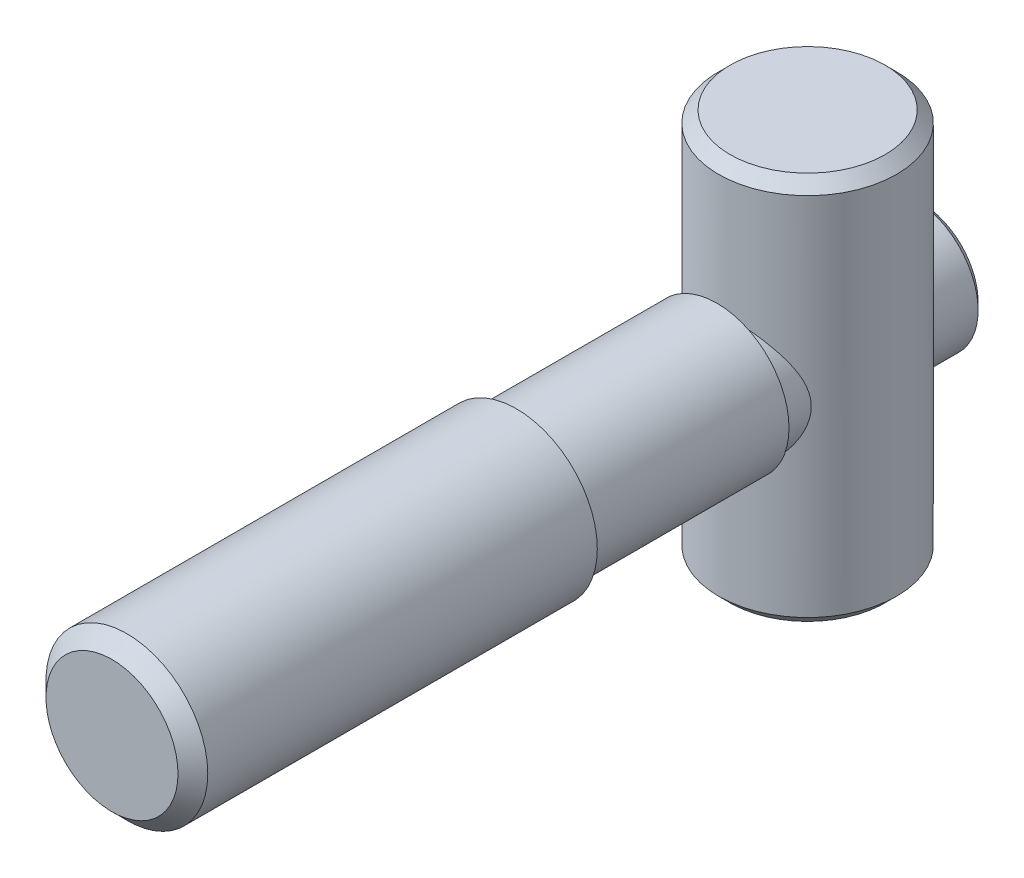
ISO-10303-21;
HEADER;
FILE_DESCRIPTION(('STEP AP214'),'2;1');
FILE_NAME('part.step','',(''),(''),'','','');
FILE_SCHEMA(('AUTOMOTIVE_DESIGN { 1 0 10303 214 1 1 1 1 }'));
ENDSEC;
DATA;
#1=APPLICATION_CONTEXT('core data for automotive mechanical design processes');
#2=APPLICATION_PROTOCOL_DEFINITION('international standard','automotive_design',2000,#1);
#3=PRODUCT_CONTEXT('',#1,'mechanical');
#4=PRODUCT('Part','Part','',(#3));
#5=PRODUCT_RELATED_PRODUCT_CATEGORY('part','',(#4));
#6=PRODUCT_DEFINITION_FORMATION('','',#4);
#7=PRODUCT_DEFINITION_CONTEXT('part definition',#1,'design');
#8=PRODUCT_DEFINITION('design','',#6,#7);
#9=PRODUCT_DEFINITION_SHAPE('','',#8);
#10=(LENGTH_UNIT() NAMED_UNIT(*) SI_UNIT(.MILLI.,.METRE.));
#11=(NAMED_UNIT(*) PLANE_ANGLE_UNIT() SI_UNIT($,.RADIAN.));
#12=(NAMED_UNIT(*) SI_UNIT($,.STERADIAN.) SOLID_ANGLE_UNIT());
#13=UNCERTAINTY_MEASURE_WITH_UNIT(LENGTH_MEASURE(1.E-05),#10,'distance_accuracy_value','');
#14=(GEOMETRIC_REPRESENTATION_CONTEXT(3) GLOBAL_UNCERTAINTY_ASSIGNED_CONTEXT((#13)) GLOBAL_UNIT_ASSIGNED_CONTEXT((#10,
#11,#12)) REPRESENTATION_CONTEXT('',''));
#15=CARTESIAN_POINT('',(0.,0.,0.));
#16=DIRECTION('',(0.,0.,1.));
#17=DIRECTION('',(1.,0.,0.));
#18=AXIS2_PLACEMENT_3D('',#15,#16,#17);
#19=CARTESIAN_POINT('',(0.,-12.,-18.3));
#20=DIRECTION('',(0.,-1.,0.));
#21=DIRECTION('',(-1.,0.,0.));
#22=AXIS2_PLACEMENT_3D('',#19,#20,#21);
#23=PLANE('',#22);
#24=CARTESIAN_POINT('',(0.,-12.,-18.3));
#25=DIRECTION('',(0.,-1.,0.));
#26=DIRECTION('',(-1.,0.,0.));
#27=AXIS2_PLACEMENT_3D('',#24,#25,#26);
#28=CIRCLE('',#27,4.79289321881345);
#29=CARTESIAN_POINT('',(-4.79289321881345,-12.,-18.3));
#30=VERTEX_POINT('',#29);
#31=EDGE_CURVE('E154',#30,#30,#28,.T.);
#32=ORIENTED_EDGE('',*,*,#31,.T.);
#33=EDGE_LOOP('',(#32));
#34=FACE_BOUND('',#33,.T.);
#35=ADVANCED_FACE('F14',(#34),#23,.T.);
#36=CARTESIAN_POINT('',(0.,12.,-18.3));
#37=DIRECTION('',(0.,1.,0.));
#38=DIRECTION('',(1.,0.,0.));
#39=AXIS2_PLACEMENT_3D('',#36,#37,#38);
#40=PLANE('',#39);
#41=CARTESIAN_POINT('',(0.,12.,-18.3));
#42=DIRECTION('',(0.,1.,0.));
#43=DIRECTION('',(1.,0.,0.));
#44=AXIS2_PLACEMENT_3D('',#41,#42,#43);
#45=CIRCLE('',#44,4.79289321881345);
#46=CARTESIAN_POINT('',(4.79289321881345,12.,-18.3));
#47=VERTEX_POINT('',#46);
#48=EDGE_CURVE('E166',#47,#47,#45,.T.);
#49=ORIENTED_EDGE('',*,*,#48,.T.);
#50=EDGE_LOOP('',(#49));
#51=FACE_BOUND('',#50,.T.);
#52=ADVANCED_FACE('F141',(#51),#40,.T.);
#53=CARTESIAN_POINT('',(0.,-12.,-18.3));
#54=DIRECTION('',(0.,1.,0.));
#55=DIRECTION('',(1.,0.,0.));
#56=AXIS2_PLACEMENT_3D('',#53,#54,#55);
#57=CONICAL_SURFACE('',#56,4.79289321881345,0.785398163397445);
#58=CARTESIAN_POINT('',(0.,-11.2928932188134,-18.3));
#59=DIRECTION('',(0.,-1.,0.));
#60=DIRECTION('',(-1.,0.,0.));
#61=AXIS2_PLACEMENT_3D('',#58,#59,#60);
#62=CIRCLE('',#61,5.5);
#63=CARTESIAN_POINT('',(-5.5,-11.2928932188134,-18.3));
#64=VERTEX_POINT('',#63);
#65=EDGE_CURVE('E162',#64,#64,#62,.F.);
#66=ORIENTED_EDGE('',*,*,#65,.F.);
#67=EDGE_LOOP('',(#66));
#68=FACE_BOUND('',#67,.T.);
#69=ORIENTED_EDGE('',*,*,#31,.F.);
#70=EDGE_LOOP('',(#69));
#71=FACE_BOUND('',#70,.T.);
#72=ADVANCED_FACE('F17',(#68,#71),#57,.T.);
#73=CARTESIAN_POINT('',(0.,12.,-18.3));
#74=DIRECTION('',(0.,-1.,0.));
#75=DIRECTION('',(-1.,0.,0.));
#76=AXIS2_PLACEMENT_3D('',#73,#74,#75);
#77=CONICAL_SURFACE('',#76,4.79289321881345,0.785398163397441);
#78=CARTESIAN_POINT('',(0.,11.2928932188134,-18.3));
#79=DIRECTION('',(0.,1.,0.));
#80=DIRECTION('',(1.,0.,0.));
#81=AXIS2_PLACEMENT_3D('',#78,#79,#80);
#82=CIRCLE('',#81,5.5);
#83=CARTESIAN_POINT('',(5.5,11.2928932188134,-18.3));
#84=VERTEX_POINT('',#83);
#85=EDGE_CURVE('E157',#84,#84,#82,.F.);
#86=ORIENTED_EDGE('',*,*,#85,.F.);
#87=EDGE_LOOP('',(#86));
#88=FACE_BOUND('',#87,.T.);
#89=ORIENTED_EDGE('',*,*,#48,.F.);
#90=EDGE_LOOP('',(#89));
#91=FACE_BOUND('',#90,.T.);
#92=ADVANCED_FACE('F126',(#88,#91),#77,.T.);
#93=CARTESIAN_POINT('',(0.,12.,-18.3));
#94=DIRECTION('',(0.,1.,0.));
#95=DIRECTION('',(1.,0.,0.));
#96=AXIS2_PLACEMENT_3D('',#93,#94,#95);
#97=CYLINDRICAL_SURFACE('',#96,5.5);
#98=DIRECTION('',(0.,1.,0.));
#99=VECTOR('',#98,1.);
#100=CARTESIAN_POINT('',(0.6,12.,-23.7671747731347));
#101=LINE('',#100,#99);
#102=CARTESIAN_POINT('',(0.6,-3.95474398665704,-23.7671747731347));
#103=VERTEX_POINT('',#102);
#104=CARTESIAN_POINT('',(0.6,3.95474398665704,-23.7671747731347));
#105=VERTEX_POINT('',#104);
#106=EDGE_CURVE('E9',#103,#105,#101,.T.);
#107=ORIENTED_EDGE('',*,*,#106,.F.);
#108=CARTESIAN_POINT('',(4.,0.,-22.0749172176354));
#109=CARTESIAN_POINT('',(3.99999971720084,0.094559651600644,-22.0749177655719));
#110=CARTESIAN_POINT('',(3.99663873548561,0.189122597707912,-22.078488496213));
#111=CARTESIAN_POINT('',(3.98328406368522,0.377297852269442,-22.0925637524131));
#112=CARTESIAN_POINT('',(3.97328671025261,0.470909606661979,-22.1030721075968));
#113=CARTESIAN_POINT('',(3.94687649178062,0.65648336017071,-22.1304732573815));
#114=CARTESIAN_POINT('',(3.93044906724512,0.748441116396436,-22.1473805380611));
#115=CARTESIAN_POINT('',(3.89152450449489,0.929870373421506,-22.1867470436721));
#116=CARTESIAN_POINT('',(3.86902376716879,1.01934036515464,-22.2092095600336));
#117=CARTESIAN_POINT('',(3.79365509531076,1.28093397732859,-22.2828450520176));
#118=CARTESIAN_POINT('',(3.73252985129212,1.44885844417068,-22.3407009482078));
#119=CARTESIAN_POINT('',(3.590688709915,1.77146295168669,-22.4672506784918));
#120=CARTESIAN_POINT('',(3.50997431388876,1.92614400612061,-22.5359436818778));
#121=CARTESIAN_POINT('',(3.31318173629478,2.25065582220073,-22.6922095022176));
#122=CARTESIAN_POINT('',(3.19328494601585,2.41764951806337,-22.7808675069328));
#123=CARTESIAN_POINT('',(2.92908108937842,2.73178094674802,-22.9578760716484));
#124=CARTESIAN_POINT('',(2.78474090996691,2.87889125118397,-23.0462260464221));
#125=CARTESIAN_POINT('',(2.5362822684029,3.09553636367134,-23.1814353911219));
#126=CARTESIAN_POINT('',(2.43963284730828,3.17231415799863,-23.2305740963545));
#127=CARTESIAN_POINT('',(2.23844845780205,3.31733570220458,-23.3251054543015));
#128=CARTESIAN_POINT('',(2.13391712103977,3.38558334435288,-23.3704998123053));
#129=CARTESIAN_POINT('',(1.91752007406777,3.51266692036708,-23.4562228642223));
#130=CARTESIAN_POINT('',(1.80566515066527,3.57151627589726,-23.49655876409));
#131=CARTESIAN_POINT('',(1.57523382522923,3.67896799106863,-23.5709873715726));
#132=CARTESIAN_POINT('',(1.45666071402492,3.72757531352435,-23.6050831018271));
#133=CARTESIAN_POINT('',(1.16188171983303,3.83193503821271,-23.678830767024));
#134=CARTESIAN_POINT('',(0.982606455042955,3.88193864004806,-23.7146815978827));
#135=CARTESIAN_POINT('',(0.616370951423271,3.95663720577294,-23.7684829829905));
#136=CARTESIAN_POINT('',(0.429417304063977,3.98135342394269,-23.7864485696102));
#137=CARTESIAN_POINT('',(0.052567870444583,4.00411402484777,-23.8029868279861));
#138=CARTESIAN_POINT('',(-0.137333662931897,4.00209732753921,-23.8015150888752));
#139=CARTESIAN_POINT('',(-0.51380986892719,3.97135939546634,-23.7791958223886));
#140=CARTESIAN_POINT('',(-0.700383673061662,3.94263129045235,-23.7583433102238));
#141=CARTESIAN_POINT('',(-1.05962164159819,3.86136821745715,-23.699944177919));
#142=CARTESIAN_POINT('',(-1.23253206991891,3.80954610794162,-23.6628980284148));
#143=CARTESIAN_POINT('',(-1.56671343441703,3.68473335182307,-23.5749694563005));
#144=CARTESIAN_POINT('',(-1.72798199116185,3.61173839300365,-23.5240842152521));
#145=CARTESIAN_POINT('',(-2.05370310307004,3.43803005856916,-23.4054456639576));
#146=CARTESIAN_POINT('',(-2.2165364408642,3.33514439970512,-23.3364494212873));
#147=CARTESIAN_POINT('',(-2.52348319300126,3.10940476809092,-23.189889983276));
#148=CARTESIAN_POINT('',(-2.66757825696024,2.98653148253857,-23.1123185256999));
#149=CARTESIAN_POINT('',(-2.96150593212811,2.69807007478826,-22.9383041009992));
#150=CARTESIAN_POINT('',(-3.10726104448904,2.52879913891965,-22.8410685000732));
#151=CARTESIAN_POINT('',(-3.36953999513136,2.16705523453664,-22.6499971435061));
#152=CARTESIAN_POINT('',(-3.48605965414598,1.97457895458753,-22.556161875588));
#153=CARTESIAN_POINT('',(-3.66526169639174,1.61165125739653,-22.402032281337));
#154=CARTESIAN_POINT('',(-3.73414032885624,1.44549066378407,-22.3388789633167));
#155=CARTESIAN_POINT('',(-3.84985589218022,1.10068331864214,-22.2287430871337));
#156=CARTESIAN_POINT('',(-3.89674227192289,0.922065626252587,-22.1817243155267));
#157=CARTESIAN_POINT('',(-3.9599937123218,0.585461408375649,-22.1170906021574));
#158=CARTESIAN_POINT('',(-3.98009730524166,0.428880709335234,-22.0959235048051));
#159=CARTESIAN_POINT('',(-4.00152507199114,0.113064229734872,-22.0733369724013));
#160=CARTESIAN_POINT('',(-4.00286519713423,-0.0461691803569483,-22.0719007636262));
#161=CARTESIAN_POINT('',(-3.98669865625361,-0.362327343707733,-22.0889767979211));
#162=CARTESIAN_POINT('',(-3.96921589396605,-0.519254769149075,-22.1074637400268));
#163=CARTESIAN_POINT('',(-3.91666535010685,-0.82717652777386,-22.1614916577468));
#164=CARTESIAN_POINT('',(-3.88157034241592,-0.978161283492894,-22.1970590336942));
#165=CARTESIAN_POINT('',(-3.77812999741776,-1.33113055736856,-22.2978469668));
#166=CARTESIAN_POINT('',(-3.70207893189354,-1.52906623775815,-22.3692423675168));
#167=CARTESIAN_POINT('',(-3.52270580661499,-1.90640842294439,-22.5254840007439));
#168=CARTESIAN_POINT('',(-3.41932922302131,-2.08577687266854,-22.6103569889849));
#169=CARTESIAN_POINT('',(-3.18411833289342,-2.43025180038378,-22.7870574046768));
#170=CARTESIAN_POINT('',(-3.05152555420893,-2.59477148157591,-22.8790168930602));
#171=CARTESIAN_POINT('',(-2.76125147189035,-2.90173861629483,-23.059699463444));
#172=CARTESIAN_POINT('',(-2.6035911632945,-3.04420434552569,-23.1484251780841));
#173=CARTESIAN_POINT('',(-2.271539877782,-3.2987599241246,-23.3122631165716));
#174=CARTESIAN_POINT('',(-2.09818660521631,-3.41190835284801,-23.3878018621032));
#175=CARTESIAN_POINT('',(-1.82330793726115,-3.56180731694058,-23.4899086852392));
#176=CARTESIAN_POINT('',(-1.72916099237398,-3.6084863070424,-23.5220894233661));
#177=CARTESIAN_POINT('',(-1.53632285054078,-3.69470582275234,-23.5820343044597));
#178=CARTESIAN_POINT('',(-1.43763386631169,-3.73424977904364,-23.6098005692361));
#179=CARTESIAN_POINT('',(-1.23534308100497,-3.80598862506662,-23.6604944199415));
#180=CARTESIAN_POINT('',(-1.13170490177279,-3.83811376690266,-23.683375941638));
#181=CARTESIAN_POINT('',(-0.921160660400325,-3.89401032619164,-23.7233693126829));
#182=CARTESIAN_POINT('',(-0.81425636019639,-3.9177861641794,-23.7404842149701));
#183=CARTESIAN_POINT('',(-0.598125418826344,-3.95655048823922,-23.7684652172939));
#184=CARTESIAN_POINT('',(-0.488900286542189,-3.9715445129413,-23.7793352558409));
#185=CARTESIAN_POINT('',(-0.269138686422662,-3.9924605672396,-23.7945144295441));
#186=CARTESIAN_POINT('',(-0.15860243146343,-3.99838404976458,-23.7988246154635));
#187=CARTESIAN_POINT('',(0.0467313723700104,-4.00084937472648,-23.8006178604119));
#188=CARTESIAN_POINT('',(0.141509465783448,-3.99861635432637,-23.7989924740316));
#189=CARTESIAN_POINT('',(0.330490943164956,-3.98744748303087,-23.7908762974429));
#190=CARTESIAN_POINT('',(0.424694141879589,-3.97850957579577,-23.7843840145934));
#191=CARTESIAN_POINT('',(0.611759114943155,-3.95406659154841,-23.7666782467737));
#192=CARTESIAN_POINT('',(0.704621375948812,-3.93856396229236,-23.7554665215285));
#193=CARTESIAN_POINT('',(0.88841574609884,-3.90122128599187,-23.7285691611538));
#194=CARTESIAN_POINT('',(0.979347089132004,-3.87937877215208,-23.7128817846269));
#195=CARTESIAN_POINT('',(1.24445933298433,-3.80583624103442,-23.6603363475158));
#196=CARTESIAN_POINT('',(1.41518501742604,-3.74554675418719,-23.6175701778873));
#197=CARTESIAN_POINT('',(1.74369677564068,-3.60438289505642,-23.5191022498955));
#198=CARTESIAN_POINT('',(1.90148075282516,-3.5235051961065,-23.4633984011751));
#199=CARTESIAN_POINT('',(2.22228203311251,-3.33179335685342,-23.3343972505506));
#200=CARTESIAN_POINT('',(2.38322541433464,-3.21841054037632,-23.2597469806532));
#201=CARTESIAN_POINT('',(2.68497920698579,-2.97136345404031,-23.103106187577));
#202=CARTESIAN_POINT('',(2.82576198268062,-2.8376718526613,-23.0211058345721));
#203=CARTESIAN_POINT('',(3.03332548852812,-2.61000808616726,-22.8888332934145));
#204=CARTESIAN_POINT('',(3.10699576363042,-2.5218601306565,-22.839152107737));
#205=CARTESIAN_POINT('',(3.24665706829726,-2.3393224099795,-22.7403298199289));
#206=CARTESIAN_POINT('',(3.31264615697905,-2.24493107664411,-22.69118885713));
#207=CARTESIAN_POINT('',(3.43660180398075,-2.0501419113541,-22.5948719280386));
#208=CARTESIAN_POINT('',(3.49457298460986,-1.94974758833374,-22.5476948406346));
#209=CARTESIAN_POINT('',(3.6021255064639,-1.74306577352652,-22.4568795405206));
#210=CARTESIAN_POINT('',(3.6517073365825,-1.63677862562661,-22.4132411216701));
#211=CARTESIAN_POINT('',(3.76078752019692,-1.37275858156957,-22.3142162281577));
#212=CARTESIAN_POINT('',(3.81580236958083,-1.21205137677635,-22.2615166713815));
#213=CARTESIAN_POINT('',(3.88309107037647,-0.963817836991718,-22.1952018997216));
#214=CARTESIAN_POINT('',(3.90296834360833,-0.879972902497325,-22.1752342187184));
#215=CARTESIAN_POINT('',(3.93739985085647,-0.710192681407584,-22.1402454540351));
#216=CARTESIAN_POINT('',(3.95195647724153,-0.62425835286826,-22.1252221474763));
#217=CARTESIAN_POINT('',(3.97571410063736,-0.449073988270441,-22.1005263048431));
#218=CARTESIAN_POINT('',(3.98480070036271,-0.359792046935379,-22.0909682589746));
#219=CARTESIAN_POINT('',(3.99694447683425,-0.180341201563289,-22.0781627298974));
#220=CARTESIAN_POINT('',(4.00000026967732,-0.0901720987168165,-22.0749166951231));
#221=CARTESIAN_POINT('',(4.,0.,-22.0749172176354));
#222=B_SPLINE_CURVE_WITH_KNOTS('',3,(#108,#109,#110,#111,#112,#113,#114,#115,#116,#117,#118,
#119,#120,#121,#122,#123,#124,#125,#126,#127,#128,#129,#130,#131,#132,#133,#134,#135,#136,#137,
#138,#139,#140,#141,#142,#143,#144,#145,#146,#147,#148,#149,#150,#151,#152,#153,#154,#155,#156,
#157,#158,#159,#160,#161,#162,#163,#164,#165,#166,#167,#168,#169,#170,#171,#172,#173,#174,#175,
#176,#177,#178,#179,#180,#181,#182,#183,#184,#185,#186,#187,#188,#189,#190,#191,#192,#193,#194,
#195,#196,#197,#198,#199,#200,#201,#202,#203,#204,#205,#206,#207,#208,#209,#210,#211,#212,#213,
#214,#215,#216,#217,#218,#219,#220,#221),.UNSPECIFIED.,.T.,.F.,(4,2,2,2,2,2,2,2,2,2,2,2,2,2,2,2,
2,2,2,2,2,2,2,2,2,2,2,2,2,2,2,2,2,2,2,2,2,2,2,2,2,2,2,2,2,2,2,2,2,2,2,2,2,2,2,2,4),(0.,
0.283560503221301,0.567277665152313,0.851640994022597,1.13617321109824,1.69729774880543,
2.25837929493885,2.92774006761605,3.59801497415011,3.99610080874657,4.39400433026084,
4.79133442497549,5.18847154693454,5.75445889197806,6.31997012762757,6.88677367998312,
7.45372305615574,8.00426875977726,8.5549266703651,9.16646484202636,9.77859745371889,
10.5066073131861,11.2347211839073,11.8047550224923,12.3735009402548,12.8491941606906,
13.3244829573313,13.7991688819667,14.2745908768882,14.94214771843,15.6110467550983,
16.2999460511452,16.9882713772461,17.6463931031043,17.9757519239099,18.3049519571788,
18.6371312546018,18.9691344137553,19.3009279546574,19.6326683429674,19.9167672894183,
20.2009534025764,20.4850336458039,20.7692245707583,21.3249022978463,21.8806698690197,
22.5100347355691,23.1402542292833,23.5154020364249,23.8906444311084,24.2656695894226,
24.6406728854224,25.1720162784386,25.4371121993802,25.7020887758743,25.9724300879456,
26.24283342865),.UNSPECIFIED.);
#223=EDGE_CURVE('E112',#103,#105,#222,.T.);
#224=ORIENTED_EDGE('',*,*,#223,.T.);
#225=EDGE_LOOP('',(#107,#224));
#226=FACE_BOUND('',#225,.T.);
#227=ORIENTED_EDGE('',*,*,#85,.T.);
#228=EDGE_LOOP('',(#227));
#229=FACE_BOUND('',#228,.T.);
#230=ORIENTED_EDGE('',*,*,#65,.T.);
#231=EDGE_LOOP('',(#230));
#232=FACE_BOUND('',#231,.T.);
#233=CARTESIAN_POINT('',(4.,0.,-14.5250827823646));
#234=CARTESIAN_POINT('',(3.99999971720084,-0.0945596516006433,-14.5250822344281));
#235=CARTESIAN_POINT('',(3.99663873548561,-0.189122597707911,-14.521511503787));
#236=CARTESIAN_POINT('',(3.98328406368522,-0.37729785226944,-14.5074362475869));
#237=CARTESIAN_POINT('',(3.97328671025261,-0.470909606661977,-14.4969278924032));
#238=CARTESIAN_POINT('',(3.94687649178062,-0.65648336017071,-14.4695267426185));
#239=CARTESIAN_POINT('',(3.93044906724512,-0.748441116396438,-14.4526194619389));
#240=CARTESIAN_POINT('',(3.89152450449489,-0.929870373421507,-14.4132529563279));
#241=CARTESIAN_POINT('',(3.86902376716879,-1.01934036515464,-14.3907904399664));
#242=CARTESIAN_POINT('',(3.79365509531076,-1.28093397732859,-14.3171549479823));
#243=CARTESIAN_POINT('',(3.73252985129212,-1.44885844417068,-14.2592990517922));
#244=CARTESIAN_POINT('',(3.590688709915,-1.7714629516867,-14.1327493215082));
#245=CARTESIAN_POINT('',(3.50997431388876,-1.92614400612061,-14.0640563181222));
#246=CARTESIAN_POINT('',(3.31318173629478,-2.25065582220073,-13.9077904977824));
#247=CARTESIAN_POINT('',(3.19328494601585,-2.41764951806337,-13.8191324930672));
#248=CARTESIAN_POINT('',(2.92908108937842,-2.73178094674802,-13.6421239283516));
#249=CARTESIAN_POINT('',(2.78474090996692,-2.87889125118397,-13.5537739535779));
#250=CARTESIAN_POINT('',(2.53628226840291,-3.09553636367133,-13.4185646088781));
#251=CARTESIAN_POINT('',(2.43963284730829,-3.17231415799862,-13.3694259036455));
#252=CARTESIAN_POINT('',(2.23844845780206,-3.31733570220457,-13.2748945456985));
#253=CARTESIAN_POINT('',(2.13391712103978,-3.38558334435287,-13.2295001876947));
#254=CARTESIAN_POINT('',(1.91752007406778,-3.51266692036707,-13.1437771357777));
#255=CARTESIAN_POINT('',(1.80566515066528,-3.57151627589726,-13.10344123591));
#256=CARTESIAN_POINT('',(1.57523382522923,-3.67896799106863,-13.0290126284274));
#257=CARTESIAN_POINT('',(1.45666071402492,-3.72757531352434,-12.9949168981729));
#258=CARTESIAN_POINT('',(1.16188171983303,-3.83193503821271,-12.921169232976));
#259=CARTESIAN_POINT('',(0.982606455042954,-3.88193864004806,-12.8853184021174));
#260=CARTESIAN_POINT('',(0.616370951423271,-3.95663720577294,-12.8315170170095));
#261=CARTESIAN_POINT('',(0.429417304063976,-3.98135342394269,-12.8135514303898));
#262=CARTESIAN_POINT('',(0.0525678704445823,-4.00411402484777,-12.7970131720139));
#263=CARTESIAN_POINT('',(-0.137333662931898,-4.00209732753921,-12.7984849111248));
#264=CARTESIAN_POINT('',(-0.51380986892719,-3.97135939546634,-12.8208041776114));
#265=CARTESIAN_POINT('',(-0.700383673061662,-3.94263129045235,-12.8416566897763));
#266=CARTESIAN_POINT('',(-1.05962164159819,-3.86136821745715,-12.900055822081));
#267=CARTESIAN_POINT('',(-1.23253206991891,-3.80954610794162,-12.9371019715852));
#268=CARTESIAN_POINT('',(-1.56671343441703,-3.68473335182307,-13.0250305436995));
#269=CARTESIAN_POINT('',(-1.72798199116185,-3.61173839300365,-13.0759157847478));
#270=CARTESIAN_POINT('',(-2.05370310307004,-3.43803005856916,-13.1945543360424));
#271=CARTESIAN_POINT('',(-2.2165364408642,-3.33514439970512,-13.2635505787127));
#272=CARTESIAN_POINT('',(-2.52348319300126,-3.10940476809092,-13.410110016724));
#273=CARTESIAN_POINT('',(-2.66757825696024,-2.98653148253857,-13.4876814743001));
#274=CARTESIAN_POINT('',(-2.96150593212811,-2.69807007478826,-13.6616958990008));
#275=CARTESIAN_POINT('',(-3.10726104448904,-2.52879913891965,-13.7589314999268));
#276=CARTESIAN_POINT('',(-3.36953999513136,-2.16705523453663,-13.9500028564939));
#277=CARTESIAN_POINT('',(-3.48605965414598,-1.97457895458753,-14.043838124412));
#278=CARTESIAN_POINT('',(-3.66526169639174,-1.61165125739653,-14.197967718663));
#279=CARTESIAN_POINT('',(-3.73414032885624,-1.44549066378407,-14.2611210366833));
#280=CARTESIAN_POINT('',(-3.84985589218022,-1.10068331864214,-14.3712569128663));
#281=CARTESIAN_POINT('',(-3.8967422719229,-0.922065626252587,-14.4182756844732));
#282=CARTESIAN_POINT('',(-3.95999371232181,-0.585461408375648,-14.4829093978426));
#283=CARTESIAN_POINT('',(-3.98009730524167,-0.428880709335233,-14.5040764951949));
#284=CARTESIAN_POINT('',(-4.00152507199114,-0.113064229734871,-14.5266630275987));
#285=CARTESIAN_POINT('',(-4.00286519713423,0.0461691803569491,-14.5280992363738));
#286=CARTESIAN_POINT('',(-3.98669865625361,0.362327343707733,-14.5110232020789));
#287=CARTESIAN_POINT('',(-3.96921589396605,0.519254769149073,-14.4925362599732));
#288=CARTESIAN_POINT('',(-3.91666535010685,0.827176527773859,-14.4385083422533));
#289=CARTESIAN_POINT('',(-3.88157034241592,0.978161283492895,-14.4029409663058));
#290=CARTESIAN_POINT('',(-3.77812999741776,1.33113055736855,-14.3021530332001));
#291=CARTESIAN_POINT('',(-3.70207893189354,1.52906623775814,-14.2307576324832));
#292=CARTESIAN_POINT('',(-3.522705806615,1.90640842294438,-14.0745159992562));
#293=CARTESIAN_POINT('',(-3.41932922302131,2.08577687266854,-13.9896430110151));
#294=CARTESIAN_POINT('',(-3.18411833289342,2.43025180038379,-13.8129425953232));
#295=CARTESIAN_POINT('',(-3.05152555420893,2.59477148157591,-13.7209831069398));
#296=CARTESIAN_POINT('',(-2.76125147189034,2.90173861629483,-13.540300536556));
#297=CARTESIAN_POINT('',(-2.6035911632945,3.04420434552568,-13.4515748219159));
#298=CARTESIAN_POINT('',(-2.271539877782,3.2987599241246,-13.2877368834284));
#299=CARTESIAN_POINT('',(-2.09818660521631,3.41190835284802,-13.2121981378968));
#300=CARTESIAN_POINT('',(-1.82330793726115,3.56180731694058,-13.1100913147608));
#301=CARTESIAN_POINT('',(-1.72916099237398,3.6084863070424,-13.0779105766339));
#302=CARTESIAN_POINT('',(-1.53632285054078,3.69470582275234,-13.0179656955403));
#303=CARTESIAN_POINT('',(-1.43763386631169,3.73424977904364,-12.990199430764));
#304=CARTESIAN_POINT('',(-1.23534308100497,3.80598862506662,-12.9395055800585));
#305=CARTESIAN_POINT('',(-1.13170490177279,3.83811376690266,-12.916624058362));
#306=CARTESIAN_POINT('',(-0.921160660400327,3.89401032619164,-12.8766306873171));
#307=CARTESIAN_POINT('',(-0.814256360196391,3.9177861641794,-12.8595157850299));
#308=CARTESIAN_POINT('',(-0.598125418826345,3.95655048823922,-12.8315347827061));
#309=CARTESIAN_POINT('',(-0.488900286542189,3.9715445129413,-12.8206647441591));
#310=CARTESIAN_POINT('',(-0.269138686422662,3.9924605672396,-12.8054855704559));
#311=CARTESIAN_POINT('',(-0.158602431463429,3.99838404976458,-12.8011753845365));
#312=CARTESIAN_POINT('',(0.046731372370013,4.00084937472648,-12.7993821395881));
#313=CARTESIAN_POINT('',(0.141509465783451,3.99861635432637,-12.8010075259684));
#314=CARTESIAN_POINT('',(0.330490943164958,3.98744748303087,-12.8091237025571));
#315=CARTESIAN_POINT('',(0.424694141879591,3.97850957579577,-12.8156159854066));
#316=CARTESIAN_POINT('',(0.611759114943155,3.95406659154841,-12.8333217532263));
#317=CARTESIAN_POINT('',(0.704621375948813,3.93856396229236,-12.8445334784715));
#318=CARTESIAN_POINT('',(0.88841574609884,3.90122128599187,-12.8714308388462));
#319=CARTESIAN_POINT('',(0.979347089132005,3.87937877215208,-12.8871182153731));
#320=CARTESIAN_POINT('',(1.24445933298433,3.80583624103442,-12.9396636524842));
#321=CARTESIAN_POINT('',(1.41518501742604,3.74554675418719,-12.9824298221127));
#322=CARTESIAN_POINT('',(1.74369677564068,3.60438289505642,-13.0808977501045));
#323=CARTESIAN_POINT('',(1.90148075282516,3.5235051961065,-13.1366015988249));
#324=CARTESIAN_POINT('',(2.22228203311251,3.33179335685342,-13.2656027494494));
#325=CARTESIAN_POINT('',(2.38322541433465,3.21841054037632,-13.3402530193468));
#326=CARTESIAN_POINT('',(2.68497920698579,2.97136345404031,-13.496893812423));
#327=CARTESIAN_POINT('',(2.82576198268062,2.8376718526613,-13.5788941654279));
#328=CARTESIAN_POINT('',(3.03332548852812,2.61000808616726,-13.7111667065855));
#329=CARTESIAN_POINT('',(3.10699576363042,2.5218601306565,-13.760847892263));
#330=CARTESIAN_POINT('',(3.24665706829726,2.33932240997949,-13.8596701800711));
#331=CARTESIAN_POINT('',(3.31264615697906,2.24493107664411,-13.9088111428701));
#332=CARTESIAN_POINT('',(3.43660180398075,2.05014191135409,-14.0051280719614));
#333=CARTESIAN_POINT('',(3.49457298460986,1.94974758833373,-14.0523051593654));
#334=CARTESIAN_POINT('',(3.60212550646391,1.74306577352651,-14.1431204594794));
#335=CARTESIAN_POINT('',(3.65170733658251,1.6367786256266,-14.18675887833));
#336=CARTESIAN_POINT('',(3.76078752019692,1.37275858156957,-14.2857837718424));
#337=CARTESIAN_POINT('',(3.81580236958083,1.21205137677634,-14.3384833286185));
#338=CARTESIAN_POINT('',(3.88309107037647,0.963817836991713,-14.4047981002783));
#339=CARTESIAN_POINT('',(3.90296834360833,0.879972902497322,-14.4247657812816));
#340=CARTESIAN_POINT('',(3.93739985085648,0.71019268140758,-14.4597545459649));
#341=CARTESIAN_POINT('',(3.95195647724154,0.624258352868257,-14.4747778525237));
#342=CARTESIAN_POINT('',(3.97571410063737,0.449073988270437,-14.4994736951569));
#343=CARTESIAN_POINT('',(3.98480070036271,0.359792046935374,-14.5090317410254));
#344=CARTESIAN_POINT('',(3.99694447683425,0.180341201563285,-14.5218372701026));
#345=CARTESIAN_POINT('',(4.00000026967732,0.0901720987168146,-14.525083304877));
#346=CARTESIAN_POINT('',(4.,0.,-14.5250827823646));
#347=B_SPLINE_CURVE_WITH_KNOTS('',3,(#233,#234,#235,#236,#237,#238,#239,#240,#241,#242,#243,
#244,#245,#246,#247,#248,#249,#250,#251,#252,#253,#254,#255,#256,#257,#258,#259,#260,#261,#262,
#263,#264,#265,#266,#267,#268,#269,#270,#271,#272,#273,#274,#275,#276,#277,#278,#279,#280,#281,
#282,#283,#284,#285,#286,#287,#288,#289,#290,#291,#292,#293,#294,#295,#296,#297,#298,#299,#300,
#301,#302,#303,#304,#305,#306,#307,#308,#309,#310,#311,#312,#313,#314,#315,#316,#317,#318,#319,
#320,#321,#322,#323,#324,#325,#326,#327,#328,#329,#330,#331,#332,#333,#334,#335,#336,#337,#338,
#339,#340,#341,#342,#343,#344,#345,#346),.UNSPECIFIED.,.T.,.F.,(4,2,2,2,2,2,2,2,2,2,2,2,2,2,2,2,
2,2,2,2,2,2,2,2,2,2,2,2,2,2,2,2,2,2,2,2,2,2,2,2,2,2,2,2,2,2,2,2,2,2,2,2,2,2,2,2,4),(0.,
0.2835605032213,0.567277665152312,0.851640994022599,1.13617321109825,1.69729774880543,
2.25837929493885,2.92774006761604,3.59801497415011,3.99610080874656,4.39400433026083,
4.79133442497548,5.18847154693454,5.75445889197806,6.31997012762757,6.88677367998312,
7.45372305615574,8.00426875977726,8.5549266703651,9.16646484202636,9.77859745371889,
10.5066073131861,11.2347211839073,11.8047550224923,12.3735009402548,12.8491941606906,
13.3244829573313,13.7991688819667,14.2745908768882,14.94214771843,15.6110467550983,
16.2999460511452,16.9882713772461,17.6463931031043,17.9757519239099,18.3049519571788,
18.6371312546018,18.9691344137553,19.3009279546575,19.6326683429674,19.9167672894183,
20.2009534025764,20.4850336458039,20.7692245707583,21.3249022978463,21.8806698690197,
22.5100347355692,23.1402542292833,23.5154020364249,23.8906444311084,24.2656695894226,
24.6406728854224,25.1720162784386,25.4371121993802,25.7020887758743,25.9724300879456,
26.24283342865),.UNSPECIFIED.);
#348=CARTESIAN_POINT('',(4.,0.,-14.5250827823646));
#349=VERTEX_POINT('',#348);
#350=EDGE_CURVE('E104',#349,#349,#347,.T.);
#351=ORIENTED_EDGE('',*,*,#350,.T.);
#352=EDGE_LOOP('',(#351));
#353=FACE_BOUND('',#352,.T.);
#354=CARTESIAN_POINT('',(-0.6,3.95474398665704,-23.7671747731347));
#355=VERTEX_POINT('',#354);
#356=CARTESIAN_POINT('',(-0.6,-3.95474398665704,-23.7671747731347));
#357=VERTEX_POINT('',#356);
#358=EDGE_CURVE('E30',#355,#357,#222,.T.);
#359=ORIENTED_EDGE('',*,*,#358,.T.);
#360=DIRECTION('',(0.,1.,0.));
#361=VECTOR('',#360,1.);
#362=CARTESIAN_POINT('',(-0.6,12.,-23.7671747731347));
#363=LINE('',#362,#361);
#364=EDGE_CURVE('E19',#357,#355,#363,.T.);
#365=ORIENTED_EDGE('',*,*,#364,.T.);
#366=EDGE_LOOP('',(#359,#365));
#367=FACE_BOUND('',#366,.T.);
#368=ADVANCED_FACE('F121',(#226,#229,#232,#353,#367),#97,.T.);
#369=CARTESIAN_POINT('',(4.08,0.,24.7));
#370=DIRECTION('',(0.,0.,-1.));
#371=DIRECTION('',(-1.,0.,0.));
#372=AXIS2_PLACEMENT_3D('',#369,#370,#371);
#373=PLANE('',#372);
#374=CARTESIAN_POINT('',(0.,0.,24.7));
#375=DIRECTION('',(0.,0.,1.));
#376=DIRECTION('',(1.,0.,0.));
#377=AXIS2_PLACEMENT_3D('',#374,#375,#376);
#378=CIRCLE('',#377,4.08);
#379=CARTESIAN_POINT('',(4.08,0.,24.7));
#380=VERTEX_POINT('',#379);
#381=EDGE_CURVE('E189',#380,#380,#378,.T.);
#382=ORIENTED_EDGE('',*,*,#381,.T.);
#383=EDGE_LOOP('',(#382));
#384=FACE_BOUND('',#383,.T.);
#385=ADVANCED_FACE('F125',(#384),#373,.F.);
#386=CARTESIAN_POINT('',(0.,0.,23.78));
#387=DIRECTION('',(0.,0.,-1.));
#388=DIRECTION('',(-1.,0.,0.));
#389=AXIS2_PLACEMENT_3D('',#386,#387,#388);
#390=CONICAL_SURFACE('',#389,5.,0.785398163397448);
#391=ORIENTED_EDGE('',*,*,#381,.F.);
#392=EDGE_LOOP('',(#391));
#393=FACE_BOUND('',#392,.T.);
#394=CARTESIAN_POINT('',(0.,0.,23.78));
#395=DIRECTION('',(0.,0.,1.));
#396=DIRECTION('',(1.,0.,0.));
#397=AXIS2_PLACEMENT_3D('',#394,#395,#396);
#398=CIRCLE('',#397,5.);
#399=CARTESIAN_POINT('',(5.,0.,23.78));
#400=VERTEX_POINT('',#399);
#401=EDGE_CURVE('E193',#400,#400,#398,.T.);
#402=ORIENTED_EDGE('',*,*,#401,.T.);
#403=EDGE_LOOP('',(#402));
#404=FACE_BOUND('',#403,.T.);
#405=ADVANCED_FACE('F217',(#393,#404),#390,.T.);
#406=CARTESIAN_POINT('',(0.,0.,24.7));
#407=DIRECTION('',(0.,0.,1.));
#408=DIRECTION('',(1.,0.,0.));
#409=AXIS2_PLACEMENT_3D('',#406,#407,#408);
#410=CYLINDRICAL_SURFACE('',#409,5.);
#411=ORIENTED_EDGE('',*,*,#401,.F.);
#412=EDGE_LOOP('',(#411));
#413=FACE_BOUND('',#412,.T.);
#414=CARTESIAN_POINT('',(0.,0.,-0.300000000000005));
#415=DIRECTION('',(0.,0.,1.));
#416=DIRECTION('',(1.,0.,0.));
#417=AXIS2_PLACEMENT_3D('',#414,#415,#416);
#418=CIRCLE('',#417,5.);
#419=CARTESIAN_POINT('',(5.,0.,-0.300000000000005));
#420=VERTEX_POINT('',#419);
#421=EDGE_CURVE('E95',#420,#420,#418,.T.);
#422=ORIENTED_EDGE('',*,*,#421,.T.);
#423=EDGE_LOOP('',(#422));
#424=FACE_BOUND('',#423,.T.);
#425=ADVANCED_FACE('F221',(#413,#424),#410,.T.);
#426=CARTESIAN_POINT('',(0.,0.,-0.300000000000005));
#427=DIRECTION('',(0.,0.,1.));
#428=DIRECTION('',(1.,0.,0.));
#429=AXIS2_PLACEMENT_3D('',#426,#427,#428);
#430=PLANE('',#429);
#431=ORIENTED_EDGE('',*,*,#421,.F.);
#432=EDGE_LOOP('',(#431));
#433=FACE_BOUND('',#432,.T.);
#434=CARTESIAN_POINT('',(0.,0.,-0.300000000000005));
#435=DIRECTION('',(0.,0.,1.));
#436=DIRECTION('',(1.,0.,0.));
#437=AXIS2_PLACEMENT_3D('',#434,#435,#436);
#438=CIRCLE('',#437,4.45);
#439=CARTESIAN_POINT('',(4.45,0.,-0.300000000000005));
#440=VERTEX_POINT('',#439);
#441=EDGE_CURVE('E91',#440,#440,#438,.T.);
#442=ORIENTED_EDGE('',*,*,#441,.T.);
#443=EDGE_LOOP('',(#442));
#444=FACE_BOUND('',#443,.T.);
#445=ADVANCED_FACE('F225',(#433,#444),#430,.F.);
#446=CARTESIAN_POINT('',(0.,0.,-0.300000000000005));
#447=DIRECTION('',(0.,0.,1.));
#448=DIRECTION('',(1.,0.,0.));
#449=AXIS2_PLACEMENT_3D('',#446,#447,#448);
#450=CYLINDRICAL_SURFACE('',#449,4.45);
#451=ORIENTED_EDGE('',*,*,#441,.F.);
#452=EDGE_LOOP('',(#451));
#453=FACE_BOUND('',#452,.T.);
#454=CARTESIAN_POINT('',(0.,0.,-12.7));
#455=DIRECTION('',(0.,0.,-1.));
#456=DIRECTION('',(-1.,0.,0.));
#457=AXIS2_PLACEMENT_3D('',#454,#455,#456);
#458=CIRCLE('',#457,4.45);
#459=CARTESIAN_POINT('',(-4.45,0.,-12.7));
#460=VERTEX_POINT('',#459);
#461=EDGE_CURVE('E84',#460,#460,#458,.T.);
#462=ORIENTED_EDGE('',*,*,#461,.F.);
#463=EDGE_LOOP('',(#462));
#464=FACE_BOUND('',#463,.T.);
#465=ADVANCED_FACE('F228',(#453,#464),#450,.T.);
#466=CARTESIAN_POINT('',(0.,0.,-12.7));
#467=DIRECTION('',(0.,0.,-1.));
#468=DIRECTION('',(-1.,0.,0.));
#469=AXIS2_PLACEMENT_3D('',#466,#467,#468);
#470=PLANE('',#469);
#471=CARTESIAN_POINT('',(0.,0.,-12.7));
#472=DIRECTION('',(0.,0.,-1.));
#473=DIRECTION('',(-1.,0.,0.));
#474=AXIS2_PLACEMENT_3D('',#471,#472,#473);
#475=CIRCLE('',#474,4.);
#476=CARTESIAN_POINT('',(-4.,0.,-12.7));
#477=VERTEX_POINT('',#476);
#478=EDGE_CURVE('E156',#477,#477,#475,.T.);
#479=ORIENTED_EDGE('',*,*,#478,.F.);
#480=EDGE_LOOP('',(#479));
#481=FACE_BOUND('',#480,.T.);
#482=ORIENTED_EDGE('',*,*,#461,.T.);
#483=EDGE_LOOP('',(#482));
#484=FACE_BOUND('',#483,.T.);
#485=ADVANCED_FACE('F231',(#481,#484),#470,.T.);
#486=CARTESIAN_POINT('',(0.,0.,-12.8));
#487=DIRECTION('',(0.,0.,1.));
#488=DIRECTION('',(1.,0.,0.));
#489=AXIS2_PLACEMENT_3D('',#486,#487,#488);
#490=CYLINDRICAL_SURFACE('',#489,4.);
#491=ORIENTED_EDGE('',*,*,#478,.T.);
#492=EDGE_LOOP('',(#491));
#493=FACE_BOUND('',#492,.T.);
#494=ORIENTED_EDGE('',*,*,#350,.F.);
#495=EDGE_LOOP('',(#494));
#496=FACE_BOUND('',#495,.T.);
#497=ADVANCED_FACE('F237',(#493,#496),#490,.T.);
#498=CARTESIAN_POINT('',(0.,0.,-25.3));
#499=DIRECTION('',(0.,0.,1.));
#500=DIRECTION('',(1.,0.,0.));
#501=AXIS2_PLACEMENT_3D('',#498,#499,#500);
#502=PLANE('',#501);
#503=DIRECTION('',(0.,-1.,0.));
#504=VECTOR('',#503,1.);
#505=CARTESIAN_POINT('',(0.6,0.,-25.3));
#506=LINE('',#505,#504);
#507=CARTESIAN_POINT('',(0.6,3.48878202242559,-25.3));
#508=VERTEX_POINT('',#507);
#509=CARTESIAN_POINT('',(0.6,-3.48878202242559,-25.3));
#510=VERTEX_POINT('',#509);
#511=EDGE_CURVE('E83',#508,#510,#506,.T.);
#512=ORIENTED_EDGE('',*,*,#511,.F.);
#513=CARTESIAN_POINT('',(0.,0.,-25.3));
#514=DIRECTION('',(0.,0.,1.));
#515=DIRECTION('',(1.,0.,0.));
#516=AXIS2_PLACEMENT_3D('',#513,#514,#515);
#517=CIRCLE('',#516,3.54);
#518=EDGE_CURVE('E82',#510,#508,#517,.T.);
#519=ORIENTED_EDGE('',*,*,#518,.F.);
#520=EDGE_LOOP('',(#512,#519));
#521=FACE_BOUND('',#520,.T.);
#522=ADVANCED_FACE('F249',(#521),#502,.F.);
#523=CARTESIAN_POINT('',(0.,0.,-25.3));
#524=DIRECTION('',(0.,0.,1.));
#525=DIRECTION('',(1.,0.,0.));
#526=AXIS2_PLACEMENT_3D('',#523,#524,#525);
#527=CONICAL_SURFACE('',#526,3.54,0.785398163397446);
#528=CARTESIAN_POINT('',(0.6,3.9554519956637,-24.8393));
#529=CARTESIAN_POINT('',(0.6,3.83941046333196,-24.9540237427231));
#530=CARTESIAN_POINT('',(0.6,3.72331727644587,-25.0686953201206));
#531=CARTESIAN_POINT('',(0.6,3.49091447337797,-25.2979511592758));
#532=CARTESIAN_POINT('',(0.6,3.37460477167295,-25.4125353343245));
#533=CARTESIAN_POINT('',(0.6,3.14054409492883,-25.642725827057));
#534=CARTESIAN_POINT('',(0.6,3.02279099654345,-25.7583299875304));
#535=CARTESIAN_POINT('',(0.6,2.78706506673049,-25.9891808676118));
#536=CARTESIAN_POINT('',(0.6,2.66909239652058,-26.1044277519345));
#537=CARTESIAN_POINT('',(0.6,2.38769992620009,-26.3783597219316));
#538=CARTESIAN_POINT('',(0.6,2.2240974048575,-26.536857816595));
#539=CARTESIAN_POINT('',(0.6,1.97745696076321,-26.7736454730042));
#540=CARTESIAN_POINT('',(0.6,1.89495476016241,-26.8524926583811));
#541=CARTESIAN_POINT('',(0.6,1.72944434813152,-27.0096193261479));
#542=CARTESIAN_POINT('',(0.6,1.64643625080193,-27.0878989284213));
#543=CARTESIAN_POINT('',(0.6,1.48033289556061,-27.2429690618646));
#544=CARTESIAN_POINT('',(0.6,1.39724415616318,-27.319766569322));
#545=CARTESIAN_POINT('',(0.6,1.2297853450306,-27.4721053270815));
#546=CARTESIAN_POINT('',(0.6,1.14541426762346,-27.5476454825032));
#547=CARTESIAN_POINT('',(0.6,1.01743134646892,-27.6590099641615));
#548=CARTESIAN_POINT('',(0.6,0.974611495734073,-27.6957423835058));
#549=CARTESIAN_POINT('',(0.6,0.88825104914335,-27.7683476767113));
#550=CARTESIAN_POINT('',(0.6,0.844710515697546,-27.8042206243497));
#551=CARTESIAN_POINT('',(0.6,0.756681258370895,-27.8746657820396));
#552=CARTESIAN_POINT('',(0.6,0.712193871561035,-27.9092396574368));
#553=CARTESIAN_POINT('',(0.6,0.621791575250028,-27.9764590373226));
#554=CARTESIAN_POINT('',(0.6,0.575877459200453,-28.0091055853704));
#555=CARTESIAN_POINT('',(0.6,0.517059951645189,-28.0479937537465));
#556=CARTESIAN_POINT('',(0.6,0.505142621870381,-28.0557273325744));
#557=CARTESIAN_POINT('',(0.6,0.481156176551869,-28.0709583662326));
#558=CARTESIAN_POINT('',(0.6,0.469087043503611,-28.0784557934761));
#559=CARTESIAN_POINT('',(0.6,0.432629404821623,-28.1005451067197));
#560=CARTESIAN_POINT('',(0.6,0.407992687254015,-28.1147326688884));
#561=CARTESIAN_POINT('',(0.6,0.358127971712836,-28.1415606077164));
#562=CARTESIAN_POINT('',(0.6,0.332906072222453,-28.1542121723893));
#563=CARTESIAN_POINT('',(0.6,0.28159268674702,-28.1776006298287));
#564=CARTESIAN_POINT('',(0.6,0.255501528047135,-28.1883382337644));
#565=CARTESIAN_POINT('',(0.6,0.19385499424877,-28.2103112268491));
#566=CARTESIAN_POINT('',(0.6,0.157946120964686,-28.2206034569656));
#567=CARTESIAN_POINT('',(0.6,0.0849893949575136,-28.2350528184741));
#568=CARTESIAN_POINT('',(0.6,0.0479465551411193,-28.2392338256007));
#569=CARTESIAN_POINT('',(0.6,-0.0264554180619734,-28.2405737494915));
#570=CARTESIAN_POINT('',(0.6,-0.0638152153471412,-28.237698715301));
#571=CARTESIAN_POINT('',(0.6,-0.137530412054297,-28.2255268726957));
#572=CARTESIAN_POINT('',(0.6,-0.173882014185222,-28.2162085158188));
#573=CARTESIAN_POINT('',(0.6,-0.246261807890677,-28.1923675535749));
#574=CARTESIAN_POINT('',(0.6,-0.282227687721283,-28.1776642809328));
#575=CARTESIAN_POINT('',(0.6,-0.352560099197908,-28.1447807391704));
#576=CARTESIAN_POINT('',(0.6,-0.386923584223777,-28.1265941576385));
#577=CARTESIAN_POINT('',(0.6,-0.454569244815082,-28.0877625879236));
#578=CARTESIAN_POINT('',(0.6,-0.487840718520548,-28.0670992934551));
#579=CARTESIAN_POINT('',(0.6,-0.553299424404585,-28.024199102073));
#580=CARTESIAN_POINT('',(0.6,-0.585487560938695,-28.0019635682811));
#581=CARTESIAN_POINT('',(0.6,-0.651811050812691,-27.9544053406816));
#582=CARTESIAN_POINT('',(0.6,-0.685873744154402,-27.928982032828));
#583=CARTESIAN_POINT('',(0.6,-0.753285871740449,-27.8772035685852));
#584=CARTESIAN_POINT('',(0.6,-0.786635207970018,-27.8508482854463));
#585=CARTESIAN_POINT('',(0.6,-0.885905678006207,-27.7707557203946));
#586=CARTESIAN_POINT('',(0.6,-0.951015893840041,-27.7160164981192));
#587=CARTESIAN_POINT('',(0.6,-1.08003348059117,-27.6049240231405));
#588=CARTESIAN_POINT('',(0.6,-1.14393845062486,-27.5485680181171));
#589=CARTESIAN_POINT('',(0.6,-1.27086154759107,-27.4349047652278));
#590=CARTESIAN_POINT('',(0.6,-1.3338799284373,-27.3775978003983));
#591=CARTESIAN_POINT('',(0.6,-1.4591376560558,-27.2625095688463));
#592=CARTESIAN_POINT('',(0.6,-1.52137875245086,-27.2047301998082));
#593=CARTESIAN_POINT('',(0.6,-1.64544200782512,-27.0887149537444));
#594=CARTESIAN_POINT('',(0.6,-1.70726413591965,-27.0304790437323));
#595=CARTESIAN_POINT('',(0.6,-1.89214348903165,-26.8554033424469));
#596=CARTESIAN_POINT('',(0.6,-2.01474045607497,-26.738078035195));
#597=CARTESIAN_POINT('',(0.6,-2.28982158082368,-26.4732317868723));
#598=CARTESIAN_POINT('',(0.6,-2.44210553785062,-26.3255035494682));
#599=CARTESIAN_POINT('',(0.6,-2.74608630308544,-26.0293359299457));
#600=CARTESIAN_POINT('',(0.6,-2.89778288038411,-25.8808963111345));
#601=CARTESIAN_POINT('',(0.6,-3.20065551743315,-25.5837234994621));
#602=CARTESIAN_POINT('',(0.6,-3.35183189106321,-25.4349906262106));
#603=CARTESIAN_POINT('',(0.6,-3.653848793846,-25.1372979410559));
#604=CARTESIAN_POINT('',(0.6,-3.80468942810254,-24.9883382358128));
#605=CARTESIAN_POINT('',(0.6,-3.9554519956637,-24.8393));
#606=B_SPLINE_CURVE_WITH_KNOTS('',3,(#528,#529,#530,#531,#532,#533,#534,#535,#536,#537,#538,
#539,#540,#541,#542,#543,#544,#545,#546,#547,#548,#549,#550,#551,#552,#553,#554,#555,#556,#557,
#558,#559,#560,#561,#562,#563,#564,#565,#566,#567,#568,#569,#570,#571,#572,#573,#574,#575,#576,
#577,#578,#579,#580,#581,#582,#583,#584,#585,#586,#587,#588,#589,#590,#591,#592,#593,#594,#595,
#596,#597,#598,#599,#600,#601,#602,#603,#604,#605),.UNSPECIFIED.,.F.,.F.,(4,2,2,2,2,2,2,2,2,2,2,
2,2,2,2,2,2,2,2,2,2,2,2,2,2,2,2,2,2,2,2,2,2,2,2,2,2,2,4),(0.,0.489535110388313,
0.979348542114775,1.47439453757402,1.96916156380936,2.65251943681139,2.99487953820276,
3.33716508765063,3.6765918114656,4.01630008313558,4.18554223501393,4.35476980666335,
4.5237724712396,4.69268277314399,4.73530049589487,4.77792317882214,4.86317585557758,
4.94776464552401,5.03232193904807,5.14397626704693,5.25519319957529,5.36694631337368,
5.47907498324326,5.5953739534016,5.71188570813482,5.82931897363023,5.94665164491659,
6.07414183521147,6.20164943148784,6.45678921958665,6.71239265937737,6.96792134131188,
7.22269628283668,7.47748980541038,7.98655823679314,8.62305059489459,9.25977190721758,
9.89599619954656,10.5319807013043),.UNSPECIFIED.);
#607=CARTESIAN_POINT('',(0.6,3.95474398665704,-24.84));
#608=VERTEX_POINT('',#607);
#609=EDGE_CURVE('E67',#608,#508,#606,.T.);
#610=ORIENTED_EDGE('',*,*,#609,.F.);
#611=CARTESIAN_POINT('',(0.,0.,-24.84));
#612=DIRECTION('',(0.,0.,1.));
#613=DIRECTION('',(1.,0.,0.));
#614=AXIS2_PLACEMENT_3D('',#611,#612,#613);
#615=CIRCLE('',#614,4.);
#616=CARTESIAN_POINT('',(0.6,-3.95474398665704,-24.84));
#617=VERTEX_POINT('',#616);
#618=EDGE_CURVE('E80',#617,#608,#615,.T.);
#619=ORIENTED_EDGE('',*,*,#618,.F.);
#620=EDGE_CURVE('E86',#510,#617,#606,.T.);
#621=ORIENTED_EDGE('',*,*,#620,.F.);
#622=ORIENTED_EDGE('',*,*,#518,.T.);
#623=EDGE_LOOP('',(#610,#619,#621,#622));
#624=FACE_BOUND('',#623,.T.);
#625=ADVANCED_FACE('F78',(#624),#527,.T.);
#626=CARTESIAN_POINT('',(0.6,0.,-54.8));
#627=DIRECTION('',(-1.,0.,0.));
#628=DIRECTION('',(0.,1.,0.));
#629=AXIS2_PLACEMENT_3D('',#626,#627,#628);
#630=PLANE('',#629);
#631=DIRECTION('',(0.,0.,1.));
#632=VECTOR('',#631,1.);
#633=CARTESIAN_POINT('',(0.6,-3.95474398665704,-12.8));
#634=LINE('',#633,#632);
#635=EDGE_CURVE('E89',#617,#103,#634,.T.);
#636=ORIENTED_EDGE('',*,*,#635,.T.);
#637=ORIENTED_EDGE('',*,*,#106,.T.);
#638=DIRECTION('',(0.,0.,1.));
#639=VECTOR('',#638,1.);
#640=CARTESIAN_POINT('',(0.6,3.95474398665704,-12.8));
#641=LINE('',#640,#639);
#642=EDGE_CURVE('E64',#105,#608,#641,.F.);
#643=ORIENTED_EDGE('',*,*,#642,.T.);
#644=ORIENTED_EDGE('',*,*,#609,.T.);
#645=ORIENTED_EDGE('',*,*,#511,.T.);
#646=ORIENTED_EDGE('',*,*,#620,.T.);
#647=EDGE_LOOP('',(#636,#637,#643,#644,#645,#646));
#648=FACE_BOUND('',#647,.T.);
#649=ADVANCED_FACE('F66',(#648),#630,.T.);
#650=ORIENTED_EDGE('',*,*,#223,.F.);
#651=ORIENTED_EDGE('',*,*,#635,.F.);
#652=ORIENTED_EDGE('',*,*,#618,.T.);
#653=ORIENTED_EDGE('',*,*,#642,.F.);
#654=EDGE_LOOP('',(#650,#651,#652,#653));
#655=FACE_BOUND('',#654,.T.);
#656=ADVANCED_FACE('F88',(#655),#490,.T.);
#657=CARTESIAN_POINT('',(-0.6,0.,-54.8));
#658=DIRECTION('',(-1.,0.,0.));
#659=DIRECTION('',(0.,1.,0.));
#660=AXIS2_PLACEMENT_3D('',#657,#658,#659);
#661=PLANE('',#660);
#662=ORIENTED_EDGE('',*,*,#364,.F.);
#663=DIRECTION('',(0.,0.,1.));
#664=VECTOR('',#663,1.);
#665=CARTESIAN_POINT('',(-0.6,-3.95474398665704,-12.8));
#666=LINE('',#665,#664);
#667=CARTESIAN_POINT('',(-0.6,-3.95474398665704,-24.84));
#668=VERTEX_POINT('',#667);
#669=EDGE_CURVE('E102',#668,#357,#666,.T.);
#670=ORIENTED_EDGE('',*,*,#669,.F.);
#671=CARTESIAN_POINT('',(-0.6,3.9554519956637,-24.8393));
#672=CARTESIAN_POINT('',(-0.6,3.83941046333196,-24.9540237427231));
#673=CARTESIAN_POINT('',(-0.6,3.72331727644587,-25.0686953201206));
#674=CARTESIAN_POINT('',(-0.6,3.49091447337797,-25.2979511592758));
#675=CARTESIAN_POINT('',(-0.6,3.37460477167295,-25.4125353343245));
#676=CARTESIAN_POINT('',(-0.6,3.14054409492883,-25.642725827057));
#677=CARTESIAN_POINT('',(-0.6,3.02279099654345,-25.7583299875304));
#678=CARTESIAN_POINT('',(-0.6,2.78706506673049,-25.9891808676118));
#679=CARTESIAN_POINT('',(-0.6,2.66909239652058,-26.1044277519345));
#680=CARTESIAN_POINT('',(-0.6,2.38769992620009,-26.3783597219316));
#681=CARTESIAN_POINT('',(-0.6,2.2240974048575,-26.536857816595));
#682=CARTESIAN_POINT('',(-0.6,1.97745696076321,-26.7736454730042));
#683=CARTESIAN_POINT('',(-0.6,1.89495476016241,-26.8524926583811));
#684=CARTESIAN_POINT('',(-0.6,1.72944434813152,-27.0096193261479));
#685=CARTESIAN_POINT('',(-0.6,1.64643625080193,-27.0878989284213));
#686=CARTESIAN_POINT('',(-0.6,1.48033289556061,-27.2429690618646));
#687=CARTESIAN_POINT('',(-0.6,1.39724415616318,-27.319766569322));
#688=CARTESIAN_POINT('',(-0.6,1.2297853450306,-27.4721053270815));
#689=CARTESIAN_POINT('',(-0.6,1.14541426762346,-27.5476454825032));
#690=CARTESIAN_POINT('',(-0.6,1.01743134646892,-27.6590099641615));
#691=CARTESIAN_POINT('',(-0.6,0.974611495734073,-27.6957423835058));
#692=CARTESIAN_POINT('',(-0.6,0.88825104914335,-27.7683476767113));
#693=CARTESIAN_POINT('',(-0.6,0.844710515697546,-27.8042206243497));
#694=CARTESIAN_POINT('',(-0.6,0.756681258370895,-27.8746657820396));
#695=CARTESIAN_POINT('',(-0.6,0.712193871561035,-27.9092396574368));
#696=CARTESIAN_POINT('',(-0.6,0.621791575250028,-27.9764590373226));
#697=CARTESIAN_POINT('',(-0.6,0.575877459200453,-28.0091055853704));
#698=CARTESIAN_POINT('',(-0.6,0.517059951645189,-28.0479937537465));
#699=CARTESIAN_POINT('',(-0.6,0.505142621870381,-28.0557273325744));
#700=CARTESIAN_POINT('',(-0.6,0.481156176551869,-28.0709583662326));
#701=CARTESIAN_POINT('',(-0.6,0.469087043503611,-28.0784557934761));
#702=CARTESIAN_POINT('',(-0.6,0.432629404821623,-28.1005451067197));
#703=CARTESIAN_POINT('',(-0.6,0.407992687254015,-28.1147326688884));
#704=CARTESIAN_POINT('',(-0.6,0.358127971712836,-28.1415606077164));
#705=CARTESIAN_POINT('',(-0.6,0.332906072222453,-28.1542121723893));
#706=CARTESIAN_POINT('',(-0.6,0.28159268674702,-28.1776006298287));
#707=CARTESIAN_POINT('',(-0.6,0.255501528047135,-28.1883382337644));
#708=CARTESIAN_POINT('',(-0.6,0.19385499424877,-28.2103112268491));
#709=CARTESIAN_POINT('',(-0.6,0.157946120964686,-28.2206034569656));
#710=CARTESIAN_POINT('',(-0.6,0.0849893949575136,-28.2350528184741));
#711=CARTESIAN_POINT('',(-0.6,0.0479465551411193,-28.2392338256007));
#712=CARTESIAN_POINT('',(-0.6,-0.0264554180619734,-28.2405737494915));
#713=CARTESIAN_POINT('',(-0.6,-0.0638152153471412,-28.237698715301));
#714=CARTESIAN_POINT('',(-0.6,-0.137530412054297,-28.2255268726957));
#715=CARTESIAN_POINT('',(-0.6,-0.173882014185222,-28.2162085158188));
#716=CARTESIAN_POINT('',(-0.6,-0.246261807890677,-28.1923675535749));
#717=CARTESIAN_POINT('',(-0.6,-0.282227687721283,-28.1776642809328));
#718=CARTESIAN_POINT('',(-0.6,-0.352560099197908,-28.1447807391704));
#719=CARTESIAN_POINT('',(-0.6,-0.386923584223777,-28.1265941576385));
#720=CARTESIAN_POINT('',(-0.6,-0.454569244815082,-28.0877625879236));
#721=CARTESIAN_POINT('',(-0.6,-0.487840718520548,-28.0670992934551));
#722=CARTESIAN_POINT('',(-0.6,-0.553299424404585,-28.024199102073));
#723=CARTESIAN_POINT('',(-0.6,-0.585487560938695,-28.0019635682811));
#724=CARTESIAN_POINT('',(-0.6,-0.651811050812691,-27.9544053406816));
#725=CARTESIAN_POINT('',(-0.6,-0.685873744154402,-27.928982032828));
#726=CARTESIAN_POINT('',(-0.6,-0.753285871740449,-27.8772035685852));
#727=CARTESIAN_POINT('',(-0.6,-0.786635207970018,-27.8508482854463));
#728=CARTESIAN_POINT('',(-0.6,-0.885905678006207,-27.7707557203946));
#729=CARTESIAN_POINT('',(-0.6,-0.951015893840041,-27.7160164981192));
#730=CARTESIAN_POINT('',(-0.6,-1.08003348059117,-27.6049240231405));
#731=CARTESIAN_POINT('',(-0.6,-1.14393845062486,-27.5485680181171));
#732=CARTESIAN_POINT('',(-0.6,-1.27086154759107,-27.4349047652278));
#733=CARTESIAN_POINT('',(-0.6,-1.3338799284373,-27.3775978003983));
#734=CARTESIAN_POINT('',(-0.6,-1.4591376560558,-27.2625095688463));
#735=CARTESIAN_POINT('',(-0.6,-1.52137875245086,-27.2047301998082));
#736=CARTESIAN_POINT('',(-0.6,-1.64544200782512,-27.0887149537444));
#737=CARTESIAN_POINT('',(-0.6,-1.70726413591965,-27.0304790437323));
#738=CARTESIAN_POINT('',(-0.6,-1.89214348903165,-26.8554033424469));
#739=CARTESIAN_POINT('',(-0.6,-2.01474045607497,-26.738078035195));
#740=CARTESIAN_POINT('',(-0.6,-2.28982158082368,-26.4732317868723));
#741=CARTESIAN_POINT('',(-0.6,-2.44210553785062,-26.3255035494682));
#742=CARTESIAN_POINT('',(-0.6,-2.74608630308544,-26.0293359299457));
#743=CARTESIAN_POINT('',(-0.6,-2.89778288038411,-25.8808963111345));
#744=CARTESIAN_POINT('',(-0.6,-3.20065551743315,-25.5837234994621));
#745=CARTESIAN_POINT('',(-0.6,-3.35183189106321,-25.4349906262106));
#746=CARTESIAN_POINT('',(-0.6,-3.653848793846,-25.1372979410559));
#747=CARTESIAN_POINT('',(-0.6,-3.80468942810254,-24.9883382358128));
#748=CARTESIAN_POINT('',(-0.6,-3.9554519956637,-24.8393));
#749=B_SPLINE_CURVE_WITH_KNOTS('',3,(#671,#672,#673,#674,#675,#676,#677,#678,#679,#680,#681,
#682,#683,#684,#685,#686,#687,#688,#689,#690,#691,#692,#693,#694,#695,#696,#697,#698,#699,#700,
#701,#702,#703,#704,#705,#706,#707,#708,#709,#710,#711,#712,#713,#714,#715,#716,#717,#718,#719,
#720,#721,#722,#723,#724,#725,#726,#727,#728,#729,#730,#731,#732,#733,#734,#735,#736,#737,#738,
#739,#740,#741,#742,#743,#744,#745,#746,#747,#748),.UNSPECIFIED.,.F.,.F.,(4,2,2,2,2,2,2,2,2,2,2,
2,2,2,2,2,2,2,2,2,2,2,2,2,2,2,2,2,2,2,2,2,2,2,2,2,2,2,4),(0.,0.489535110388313,
0.979348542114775,1.47439453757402,1.96916156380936,2.65251943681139,2.99487953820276,
3.33716508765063,3.6765918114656,4.01630008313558,4.18554223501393,4.35476980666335,
4.5237724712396,4.69268277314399,4.73530049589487,4.77792317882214,4.86317585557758,
4.94776464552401,5.03232193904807,5.14397626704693,5.25519319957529,5.36694631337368,
5.47907498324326,5.5953739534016,5.71188570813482,5.82931897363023,5.94665164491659,
6.07414183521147,6.20164943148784,6.45678921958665,6.71239265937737,6.96792134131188,
7.22269628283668,7.47748980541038,7.98655823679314,8.62305059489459,9.25977190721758,
9.89599619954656,10.5319807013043),.UNSPECIFIED.);
#750=CARTESIAN_POINT('',(-0.6,-3.48878202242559,-25.3));
#751=VERTEX_POINT('',#750);
#752=EDGE_CURVE('E187',#751,#668,#749,.T.);
#753=ORIENTED_EDGE('',*,*,#752,.F.);
#754=DIRECTION('',(0.,-1.,0.));
#755=VECTOR('',#754,1.);
#756=CARTESIAN_POINT('',(-0.6,0.,-25.3));
#757=LINE('',#756,#755);
#758=CARTESIAN_POINT('',(-0.6,3.48878202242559,-25.3));
#759=VERTEX_POINT('',#758);
#760=EDGE_CURVE('E190',#759,#751,#757,.T.);
#761=ORIENTED_EDGE('',*,*,#760,.F.);
#762=CARTESIAN_POINT('',(-0.6,3.95474398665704,-24.84));
#763=VERTEX_POINT('',#762);
#764=EDGE_CURVE('E185',#763,#759,#749,.T.);
#765=ORIENTED_EDGE('',*,*,#764,.F.);
#766=DIRECTION('',(0.,0.,1.));
#767=VECTOR('',#766,1.);
#768=CARTESIAN_POINT('',(-0.6,3.95474398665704,-12.8));
#769=LINE('',#768,#767);
#770=EDGE_CURVE('E72',#355,#763,#769,.F.);
#771=ORIENTED_EDGE('',*,*,#770,.F.);
#772=EDGE_LOOP('',(#662,#670,#753,#761,#765,#771));
#773=FACE_BOUND('',#772,.T.);
#774=ADVANCED_FACE('F177',(#773),#661,.F.);
#775=ORIENTED_EDGE('',*,*,#358,.F.);
#776=ORIENTED_EDGE('',*,*,#770,.T.);
#777=EDGE_CURVE('E90',#763,#668,#615,.T.);
#778=ORIENTED_EDGE('',*,*,#777,.T.);
#779=ORIENTED_EDGE('',*,*,#669,.T.);
#780=EDGE_LOOP('',(#775,#776,#778,#779));
#781=FACE_BOUND('',#780,.T.);
#782=ADVANCED_FACE('F117',(#781),#490,.T.);
#783=EDGE_CURVE('E73',#759,#751,#517,.T.);
#784=ORIENTED_EDGE('',*,*,#783,.F.);
#785=ORIENTED_EDGE('',*,*,#760,.T.);
#786=EDGE_LOOP('',(#784,#785));
#787=FACE_BOUND('',#786,.T.);
#788=ADVANCED_FACE('F258',(#787),#502,.F.);
#789=ORIENTED_EDGE('',*,*,#777,.F.);
#790=ORIENTED_EDGE('',*,*,#764,.T.);
#791=ORIENTED_EDGE('',*,*,#783,.T.);
#792=ORIENTED_EDGE('',*,*,#752,.T.);
#793=EDGE_LOOP('',(#789,#790,#791,#792));
#794=FACE_BOUND('',#793,.T.);
#795=ADVANCED_FACE('F183',(#794),#527,.T.);
#796=CLOSED_SHELL('',(#35,#52,#72,#92,#368,#385,#405,#425,#445,#465,#485,#497,#522,#625,#649,
#656,#774,#782,#788,#795));
#797=MANIFOLD_SOLID_BREP('B1',#796);
#798=ADVANCED_BREP_SHAPE_REPRESENTATION('',(#18,#797),#14);
#799=SHAPE_DEFINITION_REPRESENTATION(#9,#798);
ENDSEC;
END-ISO-10303-21;
